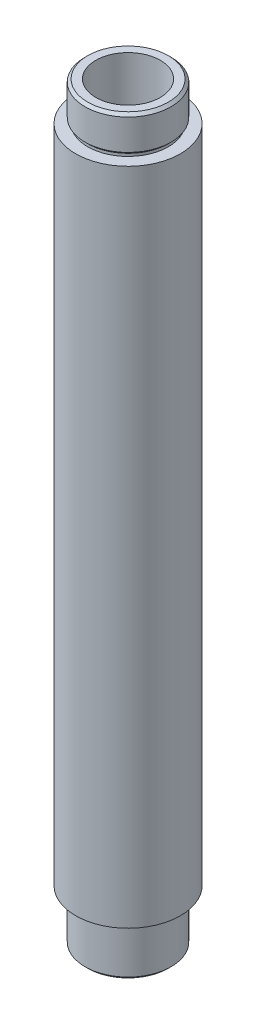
ISO-10303-21;
HEADER;
FILE_DESCRIPTION(('STEP AP214'),'2;1');
FILE_NAME('part.step','',(''),(''),'','','');
FILE_SCHEMA(('AUTOMOTIVE_DESIGN { 1 0 10303 214 1 1 1 1 }'));
ENDSEC;
DATA;
#1=APPLICATION_CONTEXT('core data for automotive mechanical design processes');
#2=APPLICATION_PROTOCOL_DEFINITION('international standard','automotive_design',2000,#1);
#3=PRODUCT_CONTEXT('',#1,'mechanical');
#4=PRODUCT('Part','Part','',(#3));
#5=PRODUCT_RELATED_PRODUCT_CATEGORY('part','',(#4));
#6=PRODUCT_DEFINITION_FORMATION('','',#4);
#7=PRODUCT_DEFINITION_CONTEXT('part definition',#1,'design');
#8=PRODUCT_DEFINITION('design','',#6,#7);
#9=PRODUCT_DEFINITION_SHAPE('','',#8);
#10=(LENGTH_UNIT() NAMED_UNIT(*) SI_UNIT(.MILLI.,.METRE.));
#11=(NAMED_UNIT(*) PLANE_ANGLE_UNIT() SI_UNIT($,.RADIAN.));
#12=(NAMED_UNIT(*) SI_UNIT($,.STERADIAN.) SOLID_ANGLE_UNIT());
#13=UNCERTAINTY_MEASURE_WITH_UNIT(LENGTH_MEASURE(1.E-05),#10,'distance_accuracy_value','');
#14=(GEOMETRIC_REPRESENTATION_CONTEXT(3) GLOBAL_UNCERTAINTY_ASSIGNED_CONTEXT((#13)) GLOBAL_UNIT_ASSIGNED_CONTEXT((#10,
#11,#12)) REPRESENTATION_CONTEXT('',''));
#15=CARTESIAN_POINT('',(0.,0.,0.));
#16=DIRECTION('',(0.,0.,1.));
#17=DIRECTION('',(1.,0.,0.));
#18=AXIS2_PLACEMENT_3D('',#15,#16,#17);
#19=CARTESIAN_POINT('',(0.,0.,0.));
#20=DIRECTION('',(0.,-1.,0.));
#21=DIRECTION('',(0.,0.,-1.));
#22=AXIS2_PLACEMENT_3D('',#19,#20,#21);
#23=CYLINDRICAL_SURFACE('',#22,15.4686);
#24=CARTESIAN_POINT('',(0.,198.25754989,0.));
#25=DIRECTION('',(0.,-1.,0.));
#26=DIRECTION('',(0.,0.,-1.));
#27=AXIS2_PLACEMENT_3D('',#24,#25,#26);
#28=CIRCLE('',#27,15.4686);
#29=CARTESIAN_POINT('',(0.,198.25754989,-15.4686));
#30=VERTEX_POINT('',#29);
#31=EDGE_CURVE('E12',#30,#30,#28,.T.);
#32=ORIENTED_EDGE('',*,*,#31,.T.);
#33=EDGE_LOOP('',(#32));
#34=FACE_BOUND('',#33,.T.);
#35=CARTESIAN_POINT('',(0.,3.33374999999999,0.));
#36=DIRECTION('',(0.,-1.,0.));
#37=DIRECTION('',(0.,0.,-1.));
#38=AXIS2_PLACEMENT_3D('',#35,#36,#37);
#39=CIRCLE('',#38,15.4686);
#40=CARTESIAN_POINT('',(0.,3.33374999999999,-15.4686));
#41=VERTEX_POINT('',#40);
#42=EDGE_CURVE('E88',#41,#41,#39,.T.);
#43=ORIENTED_EDGE('',*,*,#42,.F.);
#44=EDGE_LOOP('',(#43));
#45=FACE_BOUND('',#44,.T.);
#46=ADVANCED_FACE('F42',(#34,#45),#23,.T.);
#47=CARTESIAN_POINT('',(15.4686,198.25754989,0.));
#48=DIRECTION('',(0.,1.,0.));
#49=DIRECTION('',(0.,0.,1.));
#50=AXIS2_PLACEMENT_3D('',#47,#48,#49);
#51=PLANE('',#50);
#52=CARTESIAN_POINT('',(0.,198.25754989,0.));
#53=DIRECTION('',(0.,-1.,0.));
#54=DIRECTION('',(0.,0.,-1.));
#55=AXIS2_PLACEMENT_3D('',#52,#53,#54);
#56=CIRCLE('',#55,11.90625);
#57=CARTESIAN_POINT('',(0.,198.25754989,-11.90625));
#58=VERTEX_POINT('',#57);
#59=EDGE_CURVE('E48',#58,#58,#56,.T.);
#60=ORIENTED_EDGE('',*,*,#59,.T.);
#61=EDGE_LOOP('',(#60));
#62=FACE_BOUND('',#61,.T.);
#63=ORIENTED_EDGE('',*,*,#31,.F.);
#64=EDGE_LOOP('',(#63));
#65=FACE_BOUND('',#64,.T.);
#66=ADVANCED_FACE('F96',(#62,#65),#51,.T.);
#67=CARTESIAN_POINT('',(0.,0.,0.));
#68=DIRECTION('',(0.,-1.,0.));
#69=DIRECTION('',(0.,0.,-1.));
#70=AXIS2_PLACEMENT_3D('',#67,#68,#69);
#71=CYLINDRICAL_SURFACE('',#70,11.90625);
#72=CARTESIAN_POINT('',(0.,199.05129989,0.));
#73=DIRECTION('',(0.,-1.,0.));
#74=DIRECTION('',(0.,0.,-1.));
#75=AXIS2_PLACEMENT_3D('',#72,#73,#74);
#76=CIRCLE('',#75,11.90625);
#77=CARTESIAN_POINT('',(0.,199.05129989,-11.90625));
#78=VERTEX_POINT('',#77);
#79=EDGE_CURVE('E52',#78,#78,#76,.T.);
#80=ORIENTED_EDGE('',*,*,#79,.T.);
#81=EDGE_LOOP('',(#80));
#82=FACE_BOUND('',#81,.T.);
#83=ORIENTED_EDGE('',*,*,#59,.F.);
#84=EDGE_LOOP('',(#83));
#85=FACE_BOUND('',#84,.T.);
#86=ADVANCED_FACE('F100',(#82,#85),#71,.T.);
#87=CARTESIAN_POINT('',(0.,199.05129989,0.));
#88=DIRECTION('',(0.,1.,0.));
#89=DIRECTION('',(0.,0.,1.));
#90=AXIS2_PLACEMENT_3D('',#87,#88,#89);
#91=CONICAL_SURFACE('',#90,11.90625,0.785398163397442);
#92=CARTESIAN_POINT('',(0.,199.84504989,0.));
#93=DIRECTION('',(0.,-1.,0.));
#94=DIRECTION('',(0.,0.,-1.));
#95=AXIS2_PLACEMENT_3D('',#92,#93,#94);
#96=CIRCLE('',#95,12.7);
#97=CARTESIAN_POINT('',(0.,199.84504989,-12.7));
#98=VERTEX_POINT('',#97);
#99=EDGE_CURVE('E56',#98,#98,#96,.T.);
#100=ORIENTED_EDGE('',*,*,#99,.T.);
#101=EDGE_LOOP('',(#100));
#102=FACE_BOUND('',#101,.T.);
#103=ORIENTED_EDGE('',*,*,#79,.F.);
#104=EDGE_LOOP('',(#103));
#105=FACE_BOUND('',#104,.T.);
#106=ADVANCED_FACE('F104',(#102,#105),#91,.T.);
#107=CARTESIAN_POINT('',(0.,0.,0.));
#108=DIRECTION('',(0.,-1.,0.));
#109=DIRECTION('',(0.,0.,-1.));
#110=AXIS2_PLACEMENT_3D('',#107,#108,#109);
#111=CYLINDRICAL_SURFACE('',#110,12.7);
#112=CARTESIAN_POINT('',(0.,208.89379989,0.));
#113=DIRECTION('',(0.,-1.,0.));
#114=DIRECTION('',(0.,0.,-1.));
#115=AXIS2_PLACEMENT_3D('',#112,#113,#114);
#116=CIRCLE('',#115,12.7);
#117=CARTESIAN_POINT('',(0.,208.89379989,-12.7));
#118=VERTEX_POINT('',#117);
#119=EDGE_CURVE('E61',#118,#118,#116,.T.);
#120=ORIENTED_EDGE('',*,*,#119,.T.);
#121=EDGE_LOOP('',(#120));
#122=FACE_BOUND('',#121,.T.);
#123=ORIENTED_EDGE('',*,*,#99,.F.);
#124=EDGE_LOOP('',(#123));
#125=FACE_BOUND('',#124,.T.);
#126=ADVANCED_FACE('F111',(#122,#125),#111,.T.);
#127=CARTESIAN_POINT('',(0.,208.89379989,0.));
#128=DIRECTION('',(0.,-1.,0.));
#129=DIRECTION('',(0.,0.,-1.));
#130=AXIS2_PLACEMENT_3D('',#127,#128,#129);
#131=CONICAL_SURFACE('',#130,12.7,0.785398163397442);
#132=CARTESIAN_POINT('',(0.,209.68754989,0.));
#133=DIRECTION('',(0.,-1.,0.));
#134=DIRECTION('',(0.,0.,-1.));
#135=AXIS2_PLACEMENT_3D('',#132,#133,#134);
#136=CIRCLE('',#135,11.90625);
#137=CARTESIAN_POINT('',(0.,209.68754989,-11.90625));
#138=VERTEX_POINT('',#137);
#139=EDGE_CURVE('E64',#138,#138,#136,.T.);
#140=ORIENTED_EDGE('',*,*,#139,.T.);
#141=EDGE_LOOP('',(#140));
#142=FACE_BOUND('',#141,.T.);
#143=ORIENTED_EDGE('',*,*,#119,.F.);
#144=EDGE_LOOP('',(#143));
#145=FACE_BOUND('',#144,.T.);
#146=ADVANCED_FACE('F115',(#142,#145),#131,.T.);
#147=CARTESIAN_POINT('',(11.90625,209.68754989,0.));
#148=DIRECTION('',(0.,1.,0.));
#149=DIRECTION('',(0.,0.,1.));
#150=AXIS2_PLACEMENT_3D('',#147,#148,#149);
#151=PLANE('',#150);
#152=CARTESIAN_POINT('',(0.,209.68754989,0.));
#153=DIRECTION('',(0.,-1.,0.));
#154=DIRECTION('',(0.,0.,-1.));
#155=AXIS2_PLACEMENT_3D('',#152,#153,#154);
#156=CIRCLE('',#155,9.525);
#157=CARTESIAN_POINT('',(0.,209.68754989,-9.525));
#158=VERTEX_POINT('',#157);
#159=EDGE_CURVE('E67',#158,#158,#156,.T.);
#160=ORIENTED_EDGE('',*,*,#159,.T.);
#161=EDGE_LOOP('',(#160));
#162=FACE_BOUND('',#161,.T.);
#163=ORIENTED_EDGE('',*,*,#139,.F.);
#164=EDGE_LOOP('',(#163));
#165=FACE_BOUND('',#164,.T.);
#166=ADVANCED_FACE('F119',(#162,#165),#151,.T.);
#167=CARTESIAN_POINT('',(0.,0.,0.));
#168=DIRECTION('',(0.,-1.,0.));
#169=DIRECTION('',(0.,0.,-1.));
#170=AXIS2_PLACEMENT_3D('',#167,#168,#169);
#171=CYLINDRICAL_SURFACE('',#170,9.525);
#172=CARTESIAN_POINT('',(0.,-11.90625,0.));
#173=DIRECTION('',(0.,-1.,0.));
#174=DIRECTION('',(0.,0.,-1.));
#175=AXIS2_PLACEMENT_3D('',#172,#173,#174);
#176=CIRCLE('',#175,9.525);
#177=CARTESIAN_POINT('',(0.,-11.90625,-9.525));
#178=VERTEX_POINT('',#177);
#179=EDGE_CURVE('E70',#178,#178,#176,.T.);
#180=ORIENTED_EDGE('',*,*,#179,.T.);
#181=EDGE_LOOP('',(#180));
#182=FACE_BOUND('',#181,.T.);
#183=ORIENTED_EDGE('',*,*,#159,.F.);
#184=EDGE_LOOP('',(#183));
#185=FACE_BOUND('',#184,.T.);
#186=ADVANCED_FACE('F123',(#182,#185),#171,.F.);
#187=CARTESIAN_POINT('',(9.525,-11.90625,0.));
#188=DIRECTION('',(0.,-1.,0.));
#189=DIRECTION('',(0.,0.,-1.));
#190=AXIS2_PLACEMENT_3D('',#187,#188,#189);
#191=PLANE('',#190);
#192=CARTESIAN_POINT('',(0.,-11.90625,0.));
#193=DIRECTION('',(0.,-1.,0.));
#194=DIRECTION('',(0.,0.,-1.));
#195=AXIS2_PLACEMENT_3D('',#192,#193,#194);
#196=CIRCLE('',#195,11.90625);
#197=CARTESIAN_POINT('',(0.,-11.90625,-11.90625));
#198=VERTEX_POINT('',#197);
#199=EDGE_CURVE('E73',#198,#198,#196,.T.);
#200=ORIENTED_EDGE('',*,*,#199,.T.);
#201=EDGE_LOOP('',(#200));
#202=FACE_BOUND('',#201,.T.);
#203=ORIENTED_EDGE('',*,*,#179,.F.);
#204=EDGE_LOOP('',(#203));
#205=FACE_BOUND('',#204,.T.);
#206=ADVANCED_FACE('F127',(#202,#205),#191,.T.);
#207=CARTESIAN_POINT('',(0.,-11.90625,0.));
#208=DIRECTION('',(0.,1.,0.));
#209=DIRECTION('',(0.,0.,1.));
#210=AXIS2_PLACEMENT_3D('',#207,#208,#209);
#211=CONICAL_SURFACE('',#210,11.90625,0.785398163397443);
#212=CARTESIAN_POINT('',(0.,-11.1125,0.));
#213=DIRECTION('',(0.,-1.,0.));
#214=DIRECTION('',(0.,0.,-1.));
#215=AXIS2_PLACEMENT_3D('',#212,#213,#214);
#216=CIRCLE('',#215,12.7);
#217=CARTESIAN_POINT('',(0.,-11.1125,-12.7));
#218=VERTEX_POINT('',#217);
#219=EDGE_CURVE('E76',#218,#218,#216,.T.);
#220=ORIENTED_EDGE('',*,*,#219,.T.);
#221=EDGE_LOOP('',(#220));
#222=FACE_BOUND('',#221,.T.);
#223=ORIENTED_EDGE('',*,*,#199,.F.);
#224=EDGE_LOOP('',(#223));
#225=FACE_BOUND('',#224,.T.);
#226=ADVANCED_FACE('F131',(#222,#225),#211,.T.);
#227=CARTESIAN_POINT('',(0.,0.,0.));
#228=DIRECTION('',(0.,-1.,0.));
#229=DIRECTION('',(0.,0.,-1.));
#230=AXIS2_PLACEMENT_3D('',#227,#228,#229);
#231=CYLINDRICAL_SURFACE('',#230,12.7);
#232=CARTESIAN_POINT('',(0.,1.77799999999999,0.));
#233=DIRECTION('',(0.,-1.,0.));
#234=DIRECTION('',(0.,0.,-1.));
#235=AXIS2_PLACEMENT_3D('',#232,#233,#234);
#236=CIRCLE('',#235,12.7);
#237=CARTESIAN_POINT('',(0.,1.77799999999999,-12.7));
#238=VERTEX_POINT('',#237);
#239=EDGE_CURVE('E79',#238,#238,#236,.T.);
#240=ORIENTED_EDGE('',*,*,#239,.T.);
#241=EDGE_LOOP('',(#240));
#242=FACE_BOUND('',#241,.T.);
#243=ORIENTED_EDGE('',*,*,#219,.F.);
#244=EDGE_LOOP('',(#243));
#245=FACE_BOUND('',#244,.T.);
#246=ADVANCED_FACE('F135',(#242,#245),#231,.T.);
#247=CARTESIAN_POINT('',(0.,1.77799999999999,0.));
#248=DIRECTION('',(0.,-1.,0.));
#249=DIRECTION('',(0.,0.,-1.));
#250=AXIS2_PLACEMENT_3D('',#247,#248,#249);
#251=CONICAL_SURFACE('',#250,12.7,0.785398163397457);
#252=CARTESIAN_POINT('',(0.,2.57174999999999,0.));
#253=DIRECTION('',(0.,-1.,0.));
#254=DIRECTION('',(0.,0.,-1.));
#255=AXIS2_PLACEMENT_3D('',#252,#253,#254);
#256=CIRCLE('',#255,11.90625);
#257=CARTESIAN_POINT('',(0.,2.57174999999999,-11.90625));
#258=VERTEX_POINT('',#257);
#259=EDGE_CURVE('E82',#258,#258,#256,.T.);
#260=ORIENTED_EDGE('',*,*,#259,.T.);
#261=EDGE_LOOP('',(#260));
#262=FACE_BOUND('',#261,.T.);
#263=ORIENTED_EDGE('',*,*,#239,.F.);
#264=EDGE_LOOP('',(#263));
#265=FACE_BOUND('',#264,.T.);
#266=ADVANCED_FACE('F139',(#262,#265),#251,.T.);
#267=CARTESIAN_POINT('',(0.,0.,0.));
#268=DIRECTION('',(0.,-1.,0.));
#269=DIRECTION('',(0.,0.,-1.));
#270=AXIS2_PLACEMENT_3D('',#267,#268,#269);
#271=CYLINDRICAL_SURFACE('',#270,11.90625);
#272=CARTESIAN_POINT('',(0.,3.33374999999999,0.));
#273=DIRECTION('',(0.,-1.,0.));
#274=DIRECTION('',(0.,0.,-1.));
#275=AXIS2_PLACEMENT_3D('',#272,#273,#274);
#276=CIRCLE('',#275,11.90625);
#277=CARTESIAN_POINT('',(0.,3.33374999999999,-11.90625));
#278=VERTEX_POINT('',#277);
#279=EDGE_CURVE('E85',#278,#278,#276,.T.);
#280=ORIENTED_EDGE('',*,*,#279,.T.);
#281=EDGE_LOOP('',(#280));
#282=FACE_BOUND('',#281,.T.);
#283=ORIENTED_EDGE('',*,*,#259,.F.);
#284=EDGE_LOOP('',(#283));
#285=FACE_BOUND('',#284,.T.);
#286=ADVANCED_FACE('F143',(#282,#285),#271,.T.);
#287=CARTESIAN_POINT('',(11.90625,3.33374999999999,0.));
#288=DIRECTION('',(0.,-1.,0.));
#289=DIRECTION('',(0.,0.,-1.));
#290=AXIS2_PLACEMENT_3D('',#287,#288,#289);
#291=PLANE('',#290);
#292=ORIENTED_EDGE('',*,*,#42,.T.);
#293=EDGE_LOOP('',(#292));
#294=FACE_BOUND('',#293,.T.);
#295=ORIENTED_EDGE('',*,*,#279,.F.);
#296=EDGE_LOOP('',(#295));
#297=FACE_BOUND('',#296,.T.);
#298=ADVANCED_FACE('F92',(#294,#297),#291,.T.);
#299=CLOSED_SHELL('',(#46,#66,#86,#106,#126,#146,#166,#186,#206,#226,#246,#266,#286,#298));
#300=MANIFOLD_SOLID_BREP('B2',#299);
#301=ADVANCED_BREP_SHAPE_REPRESENTATION('',(#18,#300),#14);
#302=SHAPE_DEFINITION_REPRESENTATION(#9,#301);
ENDSEC;
END-ISO-10303-21;
